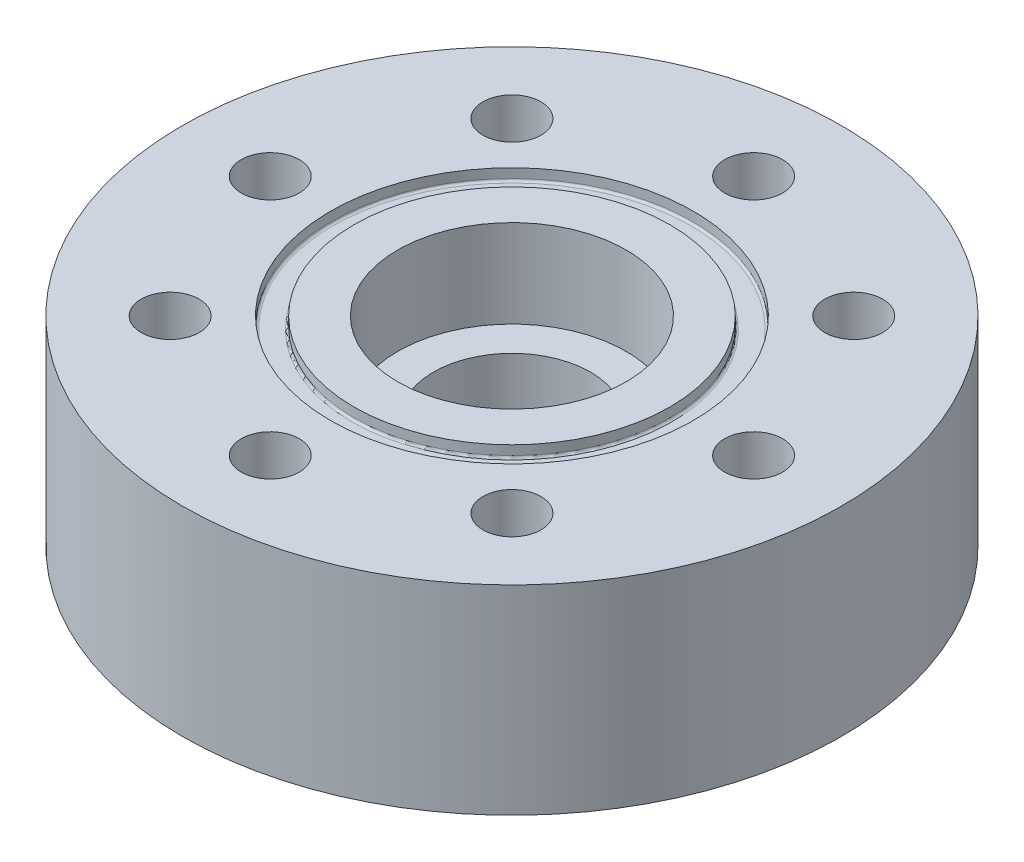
ISO-10303-21;
HEADER;
FILE_DESCRIPTION(('STEP AP214'),'2;1');
FILE_NAME('part.step','',(''),(''),'','','');
FILE_SCHEMA(('AUTOMOTIVE_DESIGN { 1 0 10303 214 1 1 1 1 }'));
ENDSEC;
DATA;
#1=APPLICATION_CONTEXT('core data for automotive mechanical design processes');
#2=APPLICATION_PROTOCOL_DEFINITION('international standard','automotive_design',2000,#1);
#3=PRODUCT_CONTEXT('',#1,'mechanical');
#4=PRODUCT('Part','Part','',(#3));
#5=PRODUCT_RELATED_PRODUCT_CATEGORY('part','',(#4));
#6=PRODUCT_DEFINITION_FORMATION('','',#4);
#7=PRODUCT_DEFINITION_CONTEXT('part definition',#1,'design');
#8=PRODUCT_DEFINITION('design','',#6,#7);
#9=PRODUCT_DEFINITION_SHAPE('','',#8);
#10=(LENGTH_UNIT() NAMED_UNIT(*) SI_UNIT(.MILLI.,.METRE.));
#11=(NAMED_UNIT(*) PLANE_ANGLE_UNIT() SI_UNIT($,.RADIAN.));
#12=(NAMED_UNIT(*) SI_UNIT($,.STERADIAN.) SOLID_ANGLE_UNIT());
#13=UNCERTAINTY_MEASURE_WITH_UNIT(LENGTH_MEASURE(1.E-05),#10,'distance_accuracy_value','');
#14=(GEOMETRIC_REPRESENTATION_CONTEXT(3) GLOBAL_UNCERTAINTY_ASSIGNED_CONTEXT((#13)) GLOBAL_UNIT_ASSIGNED_CONTEXT((#10,
#11,#12)) REPRESENTATION_CONTEXT('',''));
#15=CARTESIAN_POINT('',(0.,0.,0.));
#16=DIRECTION('',(0.,0.,1.));
#17=DIRECTION('',(1.,0.,0.));
#18=AXIS2_PLACEMENT_3D('',#15,#16,#17);
#19=CARTESIAN_POINT('',(0.,22.7,0.));
#20=DIRECTION('',(0.,-1.,0.));
#21=DIRECTION('',(0.,0.,-1.));
#22=AXIS2_PLACEMENT_3D('',#19,#20,#21);
#23=CYLINDRICAL_SURFACE('',#22,37.5);
#24=CARTESIAN_POINT('',(0.,22.7,0.));
#25=DIRECTION('',(0.,1.,0.));
#26=DIRECTION('',(0.,0.,1.));
#27=AXIS2_PLACEMENT_3D('',#24,#25,#26);
#28=CIRCLE('',#27,37.5);
#29=CARTESIAN_POINT('',(0.,22.7,37.5));
#30=VERTEX_POINT('',#29);
#31=EDGE_CURVE('E60',#30,#30,#28,.T.);
#32=ORIENTED_EDGE('',*,*,#31,.F.);
#33=EDGE_LOOP('',(#32));
#34=FACE_BOUND('',#33,.T.);
#35=CARTESIAN_POINT('',(0.,0.,0.));
#36=DIRECTION('',(0.,1.,0.));
#37=DIRECTION('',(0.,0.,1.));
#38=AXIS2_PLACEMENT_3D('',#35,#36,#37);
#39=CIRCLE('',#38,37.5);
#40=CARTESIAN_POINT('',(0.,0.,37.5));
#41=VERTEX_POINT('',#40);
#42=EDGE_CURVE('E61',#41,#41,#39,.T.);
#43=ORIENTED_EDGE('',*,*,#42,.T.);
#44=EDGE_LOOP('',(#43));
#45=FACE_BOUND('',#44,.T.);
#46=ADVANCED_FACE('F36',(#34,#45),#23,.T.);
#47=CARTESIAN_POINT('',(0.,22.7,0.));
#48=DIRECTION('',(0.,1.,0.));
#49=DIRECTION('',(0.,0.,1.));
#50=AXIS2_PLACEMENT_3D('',#47,#48,#49);
#51=PLANE('',#50);
#52=CARTESIAN_POINT('',(0.,22.7,0.));
#53=DIRECTION('',(0.,1.,0.));
#54=DIRECTION('',(0.,0.,1.));
#55=AXIS2_PLACEMENT_3D('',#52,#53,#54);
#56=CIRCLE('',#55,20.6375);
#57=CARTESIAN_POINT('',(0.,22.7,20.6375));
#58=VERTEX_POINT('',#57);
#59=EDGE_CURVE('E84',#58,#58,#56,.T.);
#60=ORIENTED_EDGE('',*,*,#59,.F.);
#61=EDGE_LOOP('',(#60));
#62=FACE_BOUND('',#61,.T.);
#63=CARTESIAN_POINT('',(-27.5,22.7,0.));
#64=DIRECTION('',(0.,-1.,0.));
#65=DIRECTION('',(0.,0.,-1.));
#66=AXIS2_PLACEMENT_3D('',#63,#64,#65);
#67=CIRCLE('',#66,3.3);
#68=CARTESIAN_POINT('',(-27.5,22.7,-3.3));
#69=VERTEX_POINT('',#68);
#70=EDGE_CURVE('E72',#69,#69,#67,.T.);
#71=ORIENTED_EDGE('',*,*,#70,.T.);
#72=EDGE_LOOP('',(#71));
#73=FACE_BOUND('',#72,.T.);
#74=CARTESIAN_POINT('',(-19.44543648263,22.7,19.4454364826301));
#75=DIRECTION('',(0.,-1.,0.));
#76=DIRECTION('',(0.,0.,-1.));
#77=AXIS2_PLACEMENT_3D('',#74,#75,#76);
#78=CIRCLE('',#77,3.30000000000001);
#79=CARTESIAN_POINT('',(-19.44543648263,22.7,16.1454364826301));
#80=VERTEX_POINT('',#79);
#81=EDGE_CURVE('E132',#80,#80,#78,.T.);
#82=ORIENTED_EDGE('',*,*,#81,.T.);
#83=EDGE_LOOP('',(#82));
#84=FACE_BOUND('',#83,.T.);
#85=CARTESIAN_POINT('',(0.,22.7,27.5));
#86=DIRECTION('',(0.,-1.,0.));
#87=DIRECTION('',(0.,0.,-1.));
#88=AXIS2_PLACEMENT_3D('',#85,#86,#87);
#89=CIRCLE('',#88,3.3);
#90=CARTESIAN_POINT('',(0.,22.7,24.2));
#91=VERTEX_POINT('',#90);
#92=EDGE_CURVE('E124',#91,#91,#89,.T.);
#93=ORIENTED_EDGE('',*,*,#92,.T.);
#94=EDGE_LOOP('',(#93));
#95=FACE_BOUND('',#94,.T.);
#96=CARTESIAN_POINT('',(19.4454364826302,22.7,19.44543648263));
#97=DIRECTION('',(0.,-1.,0.));
#98=DIRECTION('',(0.,0.,-1.));
#99=AXIS2_PLACEMENT_3D('',#96,#97,#98);
#100=CIRCLE('',#99,3.3);
#101=CARTESIAN_POINT('',(19.4454364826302,22.7,16.14543648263));
#102=VERTEX_POINT('',#101);
#103=EDGE_CURVE('E116',#102,#102,#100,.T.);
#104=ORIENTED_EDGE('',*,*,#103,.T.);
#105=EDGE_LOOP('',(#104));
#106=FACE_BOUND('',#105,.T.);
#107=CARTESIAN_POINT('',(27.5,22.7,-1.92031473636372E-13));
#108=DIRECTION('',(0.,-1.,0.));
#109=DIRECTION('',(0.,0.,-1.));
#110=AXIS2_PLACEMENT_3D('',#107,#108,#109);
#111=CIRCLE('',#110,3.3);
#112=CARTESIAN_POINT('',(27.5,22.7,-3.30000000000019));
#113=VERTEX_POINT('',#112);
#114=EDGE_CURVE('E108',#113,#113,#111,.T.);
#115=ORIENTED_EDGE('',*,*,#114,.T.);
#116=EDGE_LOOP('',(#115));
#117=FACE_BOUND('',#116,.T.);
#118=CARTESIAN_POINT('',(19.4454364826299,22.7,-19.4454364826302));
#119=DIRECTION('',(0.,-1.,0.));
#120=DIRECTION('',(0.,0.,-1.));
#121=AXIS2_PLACEMENT_3D('',#118,#119,#120);
#122=CIRCLE('',#121,3.3);
#123=CARTESIAN_POINT('',(19.4454364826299,22.7,-22.7454364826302));
#124=VERTEX_POINT('',#123);
#125=EDGE_CURVE('E100',#124,#124,#122,.T.);
#126=ORIENTED_EDGE('',*,*,#125,.T.);
#127=EDGE_LOOP('',(#126));
#128=FACE_BOUND('',#127,.T.);
#129=CARTESIAN_POINT('',(-2.88047210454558E-13,22.7,-27.5));
#130=DIRECTION('',(0.,-1.,0.));
#131=DIRECTION('',(0.,0.,-1.));
#132=AXIS2_PLACEMENT_3D('',#129,#130,#131);
#133=CIRCLE('',#132,3.3);
#134=CARTESIAN_POINT('',(-2.88047210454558E-13,22.7,-30.8));
#135=VERTEX_POINT('',#134);
#136=EDGE_CURVE('E92',#135,#135,#133,.T.);
#137=ORIENTED_EDGE('',*,*,#136,.T.);
#138=EDGE_LOOP('',(#137));
#139=FACE_BOUND('',#138,.T.);
#140=CARTESIAN_POINT('',(-19.4454364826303,22.7,-19.4454364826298));
#141=DIRECTION('',(0.,-1.,0.));
#142=DIRECTION('',(0.,0.,-1.));
#143=AXIS2_PLACEMENT_3D('',#140,#141,#142);
#144=CIRCLE('',#143,3.3);
#145=CARTESIAN_POINT('',(-19.4454364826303,22.7,-22.7454364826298));
#146=VERTEX_POINT('',#145);
#147=EDGE_CURVE('E83',#146,#146,#144,.T.);
#148=ORIENTED_EDGE('',*,*,#147,.T.);
#149=EDGE_LOOP('',(#148));
#150=FACE_BOUND('',#149,.T.);
#151=ORIENTED_EDGE('',*,*,#31,.T.);
#152=EDGE_LOOP('',(#151));
#153=FACE_BOUND('',#152,.T.);
#154=ADVANCED_FACE('F172',(#62,#73,#84,#95,#106,#117,#128,#139,#150,#153),#51,.T.);
#155=CARTESIAN_POINT('',(0.,0.,0.));
#156=DIRECTION('',(0.,1.,0.));
#157=DIRECTION('',(0.,0.,1.));
#158=AXIS2_PLACEMENT_3D('',#155,#156,#157);
#159=PLANE('',#158);
#160=CARTESIAN_POINT('',(-27.5,0.,0.));
#161=DIRECTION('',(0.,-1.,0.));
#162=DIRECTION('',(0.,0.,-1.));
#163=AXIS2_PLACEMENT_3D('',#160,#161,#162);
#164=CIRCLE('',#163,3.3);
#165=CARTESIAN_POINT('',(-27.5,0.,-3.3));
#166=VERTEX_POINT('',#165);
#167=EDGE_CURVE('E136',#166,#166,#164,.T.);
#168=ORIENTED_EDGE('',*,*,#167,.F.);
#169=EDGE_LOOP('',(#168));
#170=FACE_BOUND('',#169,.T.);
#171=CARTESIAN_POINT('',(-19.44543648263,0.,19.4454364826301));
#172=DIRECTION('',(0.,-1.,0.));
#173=DIRECTION('',(0.,0.,-1.));
#174=AXIS2_PLACEMENT_3D('',#171,#172,#173);
#175=CIRCLE('',#174,3.30000000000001);
#176=CARTESIAN_POINT('',(-19.44543648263,0.,16.1454364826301));
#177=VERTEX_POINT('',#176);
#178=EDGE_CURVE('E128',#177,#177,#175,.T.);
#179=ORIENTED_EDGE('',*,*,#178,.F.);
#180=EDGE_LOOP('',(#179));
#181=FACE_BOUND('',#180,.T.);
#182=CARTESIAN_POINT('',(0.,0.,27.5));
#183=DIRECTION('',(0.,-1.,0.));
#184=DIRECTION('',(0.,0.,-1.));
#185=AXIS2_PLACEMENT_3D('',#182,#183,#184);
#186=CIRCLE('',#185,3.3);
#187=CARTESIAN_POINT('',(0.,0.,24.2));
#188=VERTEX_POINT('',#187);
#189=EDGE_CURVE('E120',#188,#188,#186,.T.);
#190=ORIENTED_EDGE('',*,*,#189,.F.);
#191=EDGE_LOOP('',(#190));
#192=FACE_BOUND('',#191,.T.);
#193=CARTESIAN_POINT('',(19.4454364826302,0.,19.44543648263));
#194=DIRECTION('',(0.,-1.,0.));
#195=DIRECTION('',(0.,0.,-1.));
#196=AXIS2_PLACEMENT_3D('',#193,#194,#195);
#197=CIRCLE('',#196,3.3);
#198=CARTESIAN_POINT('',(19.4454364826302,0.,16.14543648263));
#199=VERTEX_POINT('',#198);
#200=EDGE_CURVE('E112',#199,#199,#197,.T.);
#201=ORIENTED_EDGE('',*,*,#200,.F.);
#202=EDGE_LOOP('',(#201));
#203=FACE_BOUND('',#202,.T.);
#204=CARTESIAN_POINT('',(27.5,0.,-1.92031473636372E-13));
#205=DIRECTION('',(0.,-1.,0.));
#206=DIRECTION('',(0.,0.,-1.));
#207=AXIS2_PLACEMENT_3D('',#204,#205,#206);
#208=CIRCLE('',#207,3.3);
#209=CARTESIAN_POINT('',(27.5,0.,-3.30000000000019));
#210=VERTEX_POINT('',#209);
#211=EDGE_CURVE('E104',#210,#210,#208,.T.);
#212=ORIENTED_EDGE('',*,*,#211,.F.);
#213=EDGE_LOOP('',(#212));
#214=FACE_BOUND('',#213,.T.);
#215=CARTESIAN_POINT('',(19.4454364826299,0.,-19.4454364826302));
#216=DIRECTION('',(0.,-1.,0.));
#217=DIRECTION('',(0.,0.,-1.));
#218=AXIS2_PLACEMENT_3D('',#215,#216,#217);
#219=CIRCLE('',#218,3.3);
#220=CARTESIAN_POINT('',(19.4454364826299,0.,-22.7454364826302));
#221=VERTEX_POINT('',#220);
#222=EDGE_CURVE('E96',#221,#221,#219,.T.);
#223=ORIENTED_EDGE('',*,*,#222,.F.);
#224=EDGE_LOOP('',(#223));
#225=FACE_BOUND('',#224,.T.);
#226=CARTESIAN_POINT('',(-2.88047210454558E-13,0.,-27.5));
#227=DIRECTION('',(0.,-1.,0.));
#228=DIRECTION('',(0.,0.,-1.));
#229=AXIS2_PLACEMENT_3D('',#226,#227,#228);
#230=CIRCLE('',#229,3.3);
#231=CARTESIAN_POINT('',(-2.88047210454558E-13,0.,-30.8));
#232=VERTEX_POINT('',#231);
#233=EDGE_CURVE('E88',#232,#232,#230,.T.);
#234=ORIENTED_EDGE('',*,*,#233,.F.);
#235=EDGE_LOOP('',(#234));
#236=FACE_BOUND('',#235,.T.);
#237=CARTESIAN_POINT('',(-19.4454364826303,0.,-19.4454364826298));
#238=DIRECTION('',(0.,-1.,0.));
#239=DIRECTION('',(0.,0.,-1.));
#240=AXIS2_PLACEMENT_3D('',#237,#238,#239);
#241=CIRCLE('',#240,3.3);
#242=CARTESIAN_POINT('',(-19.4454364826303,0.,-22.7454364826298));
#243=VERTEX_POINT('',#242);
#244=EDGE_CURVE('E79',#243,#243,#241,.T.);
#245=ORIENTED_EDGE('',*,*,#244,.F.);
#246=EDGE_LOOP('',(#245));
#247=FACE_BOUND('',#246,.T.);
#248=CARTESIAN_POINT('',(0.,0.,0.));
#249=DIRECTION('',(0.,-1.,0.));
#250=DIRECTION('',(0.,0.,-1.));
#251=AXIS2_PLACEMENT_3D('',#248,#249,#250);
#252=CIRCLE('',#251,8.93);
#253=CARTESIAN_POINT('',(0.,0.,-8.93));
#254=VERTEX_POINT('',#253);
#255=EDGE_CURVE('E65',#254,#254,#252,.T.);
#256=ORIENTED_EDGE('',*,*,#255,.F.);
#257=EDGE_LOOP('',(#256));
#258=FACE_BOUND('',#257,.T.);
#259=ORIENTED_EDGE('',*,*,#42,.F.);
#260=EDGE_LOOP('',(#259));
#261=FACE_BOUND('',#260,.T.);
#262=ADVANCED_FACE('F192',(#170,#181,#192,#203,#214,#225,#236,#247,#258,#261),#159,.F.);
#263=CARTESIAN_POINT('',(0.,12.7,0.));
#264=DIRECTION('',(0.,-1.,0.));
#265=DIRECTION('',(0.,0.,-1.));
#266=AXIS2_PLACEMENT_3D('',#263,#264,#265);
#267=CYLINDRICAL_SURFACE('',#266,8.93);
#268=CARTESIAN_POINT('',(0.,12.7,0.));
#269=DIRECTION('',(0.,-1.,0.));
#270=DIRECTION('',(0.,0.,-1.));
#271=AXIS2_PLACEMENT_3D('',#268,#269,#270);
#272=CIRCLE('',#271,8.93);
#273=CARTESIAN_POINT('',(0.,12.7,-8.93));
#274=VERTEX_POINT('',#273);
#275=EDGE_CURVE('E73',#274,#274,#272,.T.);
#276=ORIENTED_EDGE('',*,*,#275,.F.);
#277=EDGE_LOOP('',(#276));
#278=FACE_BOUND('',#277,.T.);
#279=ORIENTED_EDGE('',*,*,#255,.T.);
#280=EDGE_LOOP('',(#279));
#281=FACE_BOUND('',#280,.T.);
#282=ADVANCED_FACE('F323',(#278,#281),#267,.F.);
#283=CARTESIAN_POINT('',(-19.4454364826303,22.7,-19.4454364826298));
#284=DIRECTION('',(0.,-1.,0.));
#285=DIRECTION('',(0.,0.,-1.));
#286=AXIS2_PLACEMENT_3D('',#283,#284,#285);
#287=CYLINDRICAL_SURFACE('',#286,3.3);
#288=ORIENTED_EDGE('',*,*,#147,.F.);
#289=EDGE_LOOP('',(#288));
#290=FACE_BOUND('',#289,.T.);
#291=ORIENTED_EDGE('',*,*,#244,.T.);
#292=EDGE_LOOP('',(#291));
#293=FACE_BOUND('',#292,.T.);
#294=ADVANCED_FACE('F314',(#290,#293),#287,.F.);
#295=CARTESIAN_POINT('',(-2.88047210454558E-13,22.7,-27.5));
#296=DIRECTION('',(0.,-1.,0.));
#297=DIRECTION('',(0.,0.,-1.));
#298=AXIS2_PLACEMENT_3D('',#295,#296,#297);
#299=CYLINDRICAL_SURFACE('',#298,3.3);
#300=ORIENTED_EDGE('',*,*,#136,.F.);
#301=EDGE_LOOP('',(#300));
#302=FACE_BOUND('',#301,.T.);
#303=ORIENTED_EDGE('',*,*,#233,.T.);
#304=EDGE_LOOP('',(#303));
#305=FACE_BOUND('',#304,.T.);
#306=ADVANCED_FACE('F305',(#302,#305),#299,.F.);
#307=CARTESIAN_POINT('',(19.4454364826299,22.7,-19.4454364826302));
#308=DIRECTION('',(0.,-1.,0.));
#309=DIRECTION('',(0.,0.,-1.));
#310=AXIS2_PLACEMENT_3D('',#307,#308,#309);
#311=CYLINDRICAL_SURFACE('',#310,3.3);
#312=ORIENTED_EDGE('',*,*,#125,.F.);
#313=EDGE_LOOP('',(#312));
#314=FACE_BOUND('',#313,.T.);
#315=ORIENTED_EDGE('',*,*,#222,.T.);
#316=EDGE_LOOP('',(#315));
#317=FACE_BOUND('',#316,.T.);
#318=ADVANCED_FACE('F296',(#314,#317),#311,.F.);
#319=CARTESIAN_POINT('',(27.5,22.7,-1.92031473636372E-13));
#320=DIRECTION('',(0.,-1.,0.));
#321=DIRECTION('',(0.,0.,-1.));
#322=AXIS2_PLACEMENT_3D('',#319,#320,#321);
#323=CYLINDRICAL_SURFACE('',#322,3.3);
#324=ORIENTED_EDGE('',*,*,#114,.F.);
#325=EDGE_LOOP('',(#324));
#326=FACE_BOUND('',#325,.T.);
#327=ORIENTED_EDGE('',*,*,#211,.T.);
#328=EDGE_LOOP('',(#327));
#329=FACE_BOUND('',#328,.T.);
#330=ADVANCED_FACE('F287',(#326,#329),#323,.F.);
#331=CARTESIAN_POINT('',(19.4454364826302,22.7,19.44543648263));
#332=DIRECTION('',(0.,-1.,0.));
#333=DIRECTION('',(0.,0.,-1.));
#334=AXIS2_PLACEMENT_3D('',#331,#332,#333);
#335=CYLINDRICAL_SURFACE('',#334,3.3);
#336=ORIENTED_EDGE('',*,*,#103,.F.);
#337=EDGE_LOOP('',(#336));
#338=FACE_BOUND('',#337,.T.);
#339=ORIENTED_EDGE('',*,*,#200,.T.);
#340=EDGE_LOOP('',(#339));
#341=FACE_BOUND('',#340,.T.);
#342=ADVANCED_FACE('F278',(#338,#341),#335,.F.);
#343=CARTESIAN_POINT('',(0.,22.7,27.5));
#344=DIRECTION('',(0.,-1.,0.));
#345=DIRECTION('',(0.,0.,-1.));
#346=AXIS2_PLACEMENT_3D('',#343,#344,#345);
#347=CYLINDRICAL_SURFACE('',#346,3.3);
#348=ORIENTED_EDGE('',*,*,#92,.F.);
#349=EDGE_LOOP('',(#348));
#350=FACE_BOUND('',#349,.T.);
#351=ORIENTED_EDGE('',*,*,#189,.T.);
#352=EDGE_LOOP('',(#351));
#353=FACE_BOUND('',#352,.T.);
#354=ADVANCED_FACE('F269',(#350,#353),#347,.F.);
#355=CARTESIAN_POINT('',(-19.44543648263,22.7,19.4454364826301));
#356=DIRECTION('',(0.,-1.,0.));
#357=DIRECTION('',(0.,0.,-1.));
#358=AXIS2_PLACEMENT_3D('',#355,#356,#357);
#359=CYLINDRICAL_SURFACE('',#358,3.30000000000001);
#360=ORIENTED_EDGE('',*,*,#81,.F.);
#361=EDGE_LOOP('',(#360));
#362=FACE_BOUND('',#361,.T.);
#363=ORIENTED_EDGE('',*,*,#178,.T.);
#364=EDGE_LOOP('',(#363));
#365=FACE_BOUND('',#364,.T.);
#366=ADVANCED_FACE('F260',(#362,#365),#359,.F.);
#367=CARTESIAN_POINT('',(-27.5,22.7,0.));
#368=DIRECTION('',(0.,-1.,0.));
#369=DIRECTION('',(0.,0.,-1.));
#370=AXIS2_PLACEMENT_3D('',#367,#368,#369);
#371=CYLINDRICAL_SURFACE('',#370,3.3);
#372=ORIENTED_EDGE('',*,*,#70,.F.);
#373=EDGE_LOOP('',(#372));
#374=FACE_BOUND('',#373,.T.);
#375=ORIENTED_EDGE('',*,*,#167,.T.);
#376=EDGE_LOOP('',(#375));
#377=FACE_BOUND('',#376,.T.);
#378=ADVANCED_FACE('F246',(#374,#377),#371,.F.);
#379=CARTESIAN_POINT('',(0.,21.3792,0.));
#380=DIRECTION('',(0.,1.,0.));
#381=DIRECTION('',(0.,0.,1.));
#382=AXIS2_PLACEMENT_3D('',#379,#380,#381);
#383=CYLINDRICAL_SURFACE('',#382,20.6375);
#384=CARTESIAN_POINT('',(0.,21.6332,0.));
#385=DIRECTION('',(0.,1.,0.));
#386=DIRECTION('',(0.,0.,1.));
#387=AXIS2_PLACEMENT_3D('',#384,#385,#386);
#388=CIRCLE('',#387,20.6375);
#389=CARTESIAN_POINT('',(0.,21.6332,20.6375));
#390=VERTEX_POINT('',#389);
#391=EDGE_CURVE('E10',#390,#390,#388,.F.);
#392=ORIENTED_EDGE('',*,*,#391,.T.);
#393=EDGE_LOOP('',(#392));
#394=FACE_BOUND('',#393,.T.);
#395=ORIENTED_EDGE('',*,*,#59,.T.);
#396=EDGE_LOOP('',(#395));
#397=FACE_BOUND('',#396,.T.);
#398=ADVANCED_FACE('F183',(#394,#397),#383,.F.);
#399=CARTESIAN_POINT('',(0.,21.3792,0.));
#400=DIRECTION('',(0.,1.,0.));
#401=DIRECTION('',(0.,0.,1.));
#402=AXIS2_PLACEMENT_3D('',#399,#400,#401);
#403=PLANE('',#402);
#404=CARTESIAN_POINT('',(0.,21.3792,0.));
#405=DIRECTION('',(0.,1.,0.));
#406=DIRECTION('',(0.,0.,1.));
#407=AXIS2_PLACEMENT_3D('',#404,#405,#406);
#408=CIRCLE('',#407,18.2245);
#409=CARTESIAN_POINT('',(0.,21.3792,18.2245));
#410=VERTEX_POINT('',#409);
#411=EDGE_CURVE('E44',#410,#410,#408,.F.);
#412=ORIENTED_EDGE('',*,*,#411,.T.);
#413=EDGE_LOOP('',(#412));
#414=FACE_BOUND('',#413,.T.);
#415=CARTESIAN_POINT('',(0.,21.3792,0.));
#416=DIRECTION('',(0.,1.,0.));
#417=DIRECTION('',(0.,0.,1.));
#418=AXIS2_PLACEMENT_3D('',#415,#416,#417);
#419=CIRCLE('',#418,20.3835);
#420=CARTESIAN_POINT('',(0.,21.3792,20.3835));
#421=VERTEX_POINT('',#420);
#422=EDGE_CURVE('E49',#421,#421,#419,.T.);
#423=ORIENTED_EDGE('',*,*,#422,.T.);
#424=EDGE_LOOP('',(#423));
#425=FACE_BOUND('',#424,.T.);
#426=ADVANCED_FACE('F176',(#414,#425),#403,.T.);
#427=CARTESIAN_POINT('',(0.,21.3792,0.));
#428=DIRECTION('',(0.,1.,0.));
#429=DIRECTION('',(0.,0.,1.));
#430=AXIS2_PLACEMENT_3D('',#427,#428,#429);
#431=CYLINDRICAL_SURFACE('',#430,17.9705);
#432=CARTESIAN_POINT('',(0.,21.6332,0.));
#433=DIRECTION('',(0.,1.,0.));
#434=DIRECTION('',(0.,0.,1.));
#435=AXIS2_PLACEMENT_3D('',#432,#433,#434);
#436=CIRCLE('',#435,17.9705);
#437=CARTESIAN_POINT('',(0.,21.6332,17.9705));
#438=VERTEX_POINT('',#437);
#439=EDGE_CURVE('E54',#438,#438,#436,.T.);
#440=ORIENTED_EDGE('',*,*,#439,.T.);
#441=EDGE_LOOP('',(#440));
#442=FACE_BOUND('',#441,.T.);
#443=CARTESIAN_POINT('',(0.,22.7,0.));
#444=DIRECTION('',(0.,1.,0.));
#445=DIRECTION('',(0.,0.,1.));
#446=AXIS2_PLACEMENT_3D('',#443,#444,#445);
#447=CIRCLE('',#446,17.9705);
#448=CARTESIAN_POINT('',(0.,22.7,17.9705));
#449=VERTEX_POINT('',#448);
#450=EDGE_CURVE('E77',#449,#449,#447,.T.);
#451=ORIENTED_EDGE('',*,*,#450,.F.);
#452=EDGE_LOOP('',(#451));
#453=FACE_BOUND('',#452,.T.);
#454=ADVANCED_FACE('F170',(#442,#453),#431,.T.);
#455=CARTESIAN_POINT('',(0.,22.7,0.));
#456=DIRECTION('',(0.,1.,0.));
#457=DIRECTION('',(0.,0.,1.));
#458=AXIS2_PLACEMENT_3D('',#455,#456,#457);
#459=CIRCLE('',#458,13.);
#460=CARTESIAN_POINT('',(0.,22.7,13.));
#461=VERTEX_POINT('',#460);
#462=EDGE_CURVE('E149',#461,#461,#459,.T.);
#463=ORIENTED_EDGE('',*,*,#462,.F.);
#464=EDGE_LOOP('',(#463));
#465=FACE_BOUND('',#464,.T.);
#466=ORIENTED_EDGE('',*,*,#450,.T.);
#467=EDGE_LOOP('',(#466));
#468=FACE_BOUND('',#467,.T.);
#469=ADVANCED_FACE('F166',(#465,#468),#51,.T.);
#470=CARTESIAN_POINT('',(0.,21.6332,0.));
#471=DIRECTION('',(0.,1.,0.));
#472=DIRECTION('',(0.,0.,1.));
#473=AXIS2_PLACEMENT_3D('',#470,#471,#472);
#474=TOROIDAL_SURFACE('',#473,18.2245,0.254);
#475=ORIENTED_EDGE('',*,*,#411,.F.);
#476=EDGE_LOOP('',(#475));
#477=FACE_BOUND('',#476,.T.);
#478=ORIENTED_EDGE('',*,*,#439,.F.);
#479=EDGE_LOOP('',(#478));
#480=FACE_BOUND('',#479,.T.);
#481=ADVANCED_FACE('F169',(#477,#480),#474,.F.);
#482=CARTESIAN_POINT('',(0.,21.6332,0.));
#483=DIRECTION('',(0.,1.,0.));
#484=DIRECTION('',(0.,0.,1.));
#485=AXIS2_PLACEMENT_3D('',#482,#483,#484);
#486=TOROIDAL_SURFACE('',#485,20.3835,0.254);
#487=ORIENTED_EDGE('',*,*,#391,.F.);
#488=EDGE_LOOP('',(#487));
#489=FACE_BOUND('',#488,.T.);
#490=ORIENTED_EDGE('',*,*,#422,.F.);
#491=EDGE_LOOP('',(#490));
#492=FACE_BOUND('',#491,.T.);
#493=ADVANCED_FACE('F38',(#489,#492),#486,.F.);
#494=CARTESIAN_POINT('',(0.,12.7,0.));
#495=DIRECTION('',(0.,1.,0.));
#496=DIRECTION('',(0.,0.,1.));
#497=AXIS2_PLACEMENT_3D('',#494,#495,#496);
#498=PLANE('',#497);
#499=CARTESIAN_POINT('',(0.,12.7,0.));
#500=DIRECTION('',(0.,1.,0.));
#501=DIRECTION('',(0.,0.,1.));
#502=AXIS2_PLACEMENT_3D('',#499,#500,#501);
#503=CIRCLE('',#502,13.);
#504=CARTESIAN_POINT('',(0.,12.7,13.));
#505=VERTEX_POINT('',#504);
#506=EDGE_CURVE('E78',#505,#505,#503,.T.);
#507=ORIENTED_EDGE('',*,*,#506,.T.);
#508=EDGE_LOOP('',(#507));
#509=FACE_BOUND('',#508,.T.);
#510=ORIENTED_EDGE('',*,*,#275,.T.);
#511=EDGE_LOOP('',(#510));
#512=FACE_BOUND('',#511,.T.);
#513=ADVANCED_FACE('F157',(#509,#512),#498,.T.);
#514=CARTESIAN_POINT('',(0.,12.7,0.));
#515=DIRECTION('',(0.,1.,0.));
#516=DIRECTION('',(0.,0.,1.));
#517=AXIS2_PLACEMENT_3D('',#514,#515,#516);
#518=CYLINDRICAL_SURFACE('',#517,13.);
#519=ORIENTED_EDGE('',*,*,#506,.F.);
#520=EDGE_LOOP('',(#519));
#521=FACE_BOUND('',#520,.T.);
#522=ORIENTED_EDGE('',*,*,#462,.T.);
#523=EDGE_LOOP('',(#522));
#524=FACE_BOUND('',#523,.T.);
#525=ADVANCED_FACE('F160',(#521,#524),#518,.F.);
#526=CLOSED_SHELL('',(#46,#154,#262,#282,#294,#306,#318,#330,#342,#354,#366,#378,#398,#426,#454,
#469,#481,#493,#513,#525));
#527=MANIFOLD_SOLID_BREP('B2',#526);
#528=ADVANCED_BREP_SHAPE_REPRESENTATION('',(#18,#527),#14);
#529=SHAPE_DEFINITION_REPRESENTATION(#9,#528);
ENDSEC;
END-ISO-10303-21;
